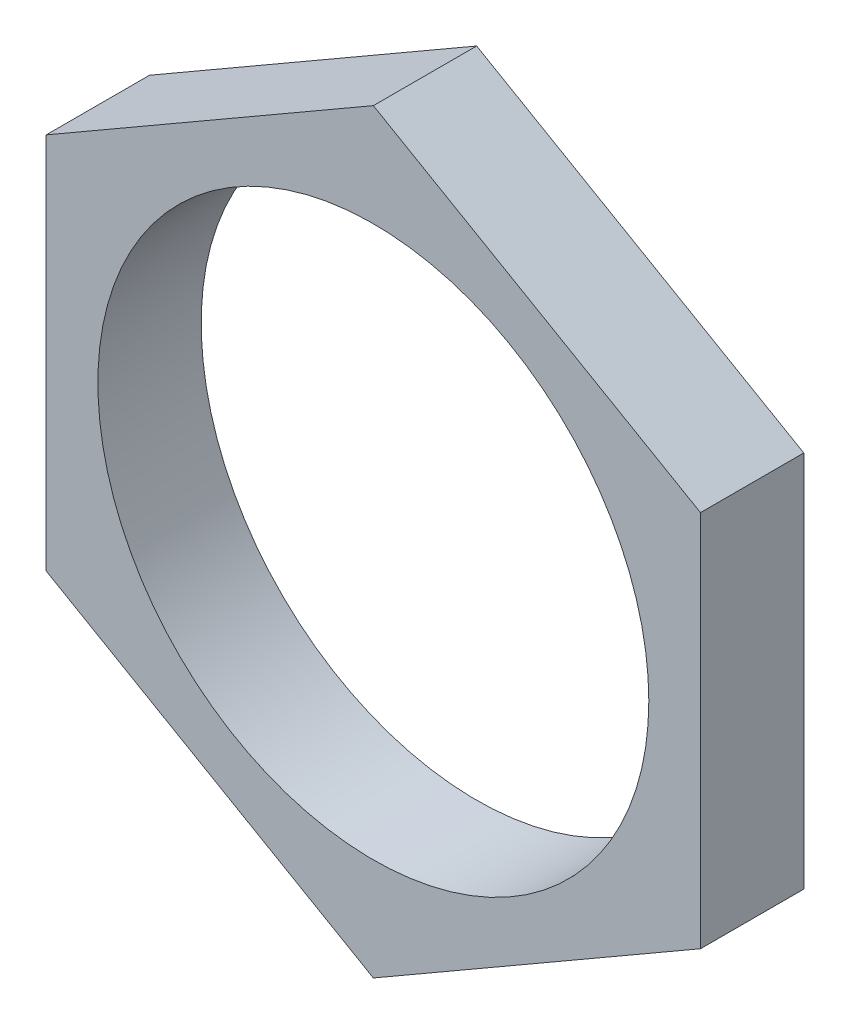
ISO-10303-21;
HEADER;
FILE_DESCRIPTION(('STEP AP214'),'2;1');
FILE_NAME('part.step','',(''),(''),'','','');
FILE_SCHEMA(('AUTOMOTIVE_DESIGN { 1 0 10303 214 1 1 1 1 }'));
ENDSEC;
DATA;
#1=APPLICATION_CONTEXT('core data for automotive mechanical design processes');
#2=APPLICATION_PROTOCOL_DEFINITION('international standard','automotive_design',2000,#1);
#3=PRODUCT_CONTEXT('',#1,'mechanical');
#4=PRODUCT('Part','Part','',(#3));
#5=PRODUCT_RELATED_PRODUCT_CATEGORY('part','',(#4));
#6=PRODUCT_DEFINITION_FORMATION('','',#4);
#7=PRODUCT_DEFINITION_CONTEXT('part definition',#1,'design');
#8=PRODUCT_DEFINITION('design','',#6,#7);
#9=PRODUCT_DEFINITION_SHAPE('','',#8);
#10=(LENGTH_UNIT() NAMED_UNIT(*) SI_UNIT(.MILLI.,.METRE.));
#11=(NAMED_UNIT(*) PLANE_ANGLE_UNIT() SI_UNIT($,.RADIAN.));
#12=(NAMED_UNIT(*) SI_UNIT($,.STERADIAN.) SOLID_ANGLE_UNIT());
#13=UNCERTAINTY_MEASURE_WITH_UNIT(LENGTH_MEASURE(1.E-05),#10,'distance_accuracy_value','');
#14=(GEOMETRIC_REPRESENTATION_CONTEXT(3) GLOBAL_UNCERTAINTY_ASSIGNED_CONTEXT((#13)) GLOBAL_UNIT_ASSIGNED_CONTEXT((#10,
#11,#12)) REPRESENTATION_CONTEXT('',''));
#15=CARTESIAN_POINT('',(0.,0.,0.));
#16=DIRECTION('',(0.,0.,1.));
#17=DIRECTION('',(1.,0.,0.));
#18=AXIS2_PLACEMENT_3D('',#15,#16,#17);
#19=CARTESIAN_POINT('',(0.,10.969655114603,3.));
#20=DIRECTION('',(0.,0.,-1.));
#21=DIRECTION('',(-1.,0.,0.));
#22=AXIS2_PLACEMENT_3D('',#19,#20,#21);
#23=PLANE('',#22);
#24=DIRECTION('',(-0.866025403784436,0.5,0.));
#25=VECTOR('',#24,1.);
#26=CARTESIAN_POINT('',(9.5,5.48482755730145,3.));
#27=LINE('',#26,#25);
#28=CARTESIAN_POINT('',(9.5,5.48482755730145,3.));
#29=VERTEX_POINT('',#28);
#30=CARTESIAN_POINT('',(0.,10.969655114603,3.));
#31=VERTEX_POINT('',#30);
#32=EDGE_CURVE('E100',#29,#31,#27,.T.);
#33=ORIENTED_EDGE('',*,*,#32,.T.);
#34=DIRECTION('',(0.866025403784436,0.5,0.));
#35=VECTOR('',#34,1.);
#36=CARTESIAN_POINT('',(-9.5,5.48482755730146,3.));
#37=LINE('',#36,#35);
#38=CARTESIAN_POINT('',(-9.5,5.48482755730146,3.));
#39=VERTEX_POINT('',#38);
#40=EDGE_CURVE('E73',#39,#31,#37,.T.);
#41=ORIENTED_EDGE('',*,*,#40,.F.);
#42=DIRECTION('',(0.,-1.,0.));
#43=VECTOR('',#42,1.);
#44=CARTESIAN_POINT('',(-9.5,5.48482755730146,3.));
#45=LINE('',#44,#43);
#46=CARTESIAN_POINT('',(-9.5,-5.48482755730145,3.));
#47=VERTEX_POINT('',#46);
#48=EDGE_CURVE('E103',#39,#47,#45,.T.);
#49=ORIENTED_EDGE('',*,*,#48,.T.);
#50=DIRECTION('',(0.866025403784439,-0.5,0.));
#51=VECTOR('',#50,1.);
#52=CARTESIAN_POINT('',(-9.5,-5.48482755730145,3.));
#53=LINE('',#52,#51);
#54=CARTESIAN_POINT('',(0.,-10.9696551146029,3.));
#55=VERTEX_POINT('',#54);
#56=EDGE_CURVE('E106',#47,#55,#53,.T.);
#57=ORIENTED_EDGE('',*,*,#56,.T.);
#58=DIRECTION('',(-0.86602540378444,-0.5,0.));
#59=VECTOR('',#58,1.);
#60=CARTESIAN_POINT('',(9.5,-5.48482755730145,3.));
#61=LINE('',#60,#59);
#62=CARTESIAN_POINT('',(9.5,-5.48482755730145,3.));
#63=VERTEX_POINT('',#62);
#64=EDGE_CURVE('E109',#63,#55,#61,.T.);
#65=ORIENTED_EDGE('',*,*,#64,.F.);
#66=DIRECTION('',(0.,-1.,0.));
#67=VECTOR('',#66,1.);
#68=CARTESIAN_POINT('',(9.5,5.48482755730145,3.));
#69=LINE('',#68,#67);
#70=EDGE_CURVE('E111',#29,#63,#69,.T.);
#71=ORIENTED_EDGE('',*,*,#70,.F.);
#72=EDGE_LOOP('',(#33,#41,#49,#57,#65,#71));
#73=FACE_BOUND('',#72,.T.);
#74=CARTESIAN_POINT('',(0.,0.,3.));
#75=DIRECTION('',(0.,0.,1.));
#76=DIRECTION('',(1.,0.,0.));
#77=AXIS2_PLACEMENT_3D('',#74,#75,#76);
#78=CIRCLE('',#77,8.);
#79=CARTESIAN_POINT('',(8.,0.,3.));
#80=VERTEX_POINT('',#79);
#81=EDGE_CURVE('E81',#80,#80,#78,.T.);
#82=ORIENTED_EDGE('',*,*,#81,.F.);
#83=EDGE_LOOP('',(#82));
#84=FACE_BOUND('',#83,.T.);
#85=ADVANCED_FACE('F14',(#73,#84),#23,.F.);
#86=CARTESIAN_POINT('',(0.,10.969655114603,0.));
#87=DIRECTION('',(0.,0.,-1.));
#88=DIRECTION('',(-1.,0.,0.));
#89=AXIS2_PLACEMENT_3D('',#86,#87,#88);
#90=PLANE('',#89);
#91=DIRECTION('',(-0.866025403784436,0.5,0.));
#92=VECTOR('',#91,1.);
#93=CARTESIAN_POINT('',(9.5,5.48482755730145,0.));
#94=LINE('',#93,#92);
#95=CARTESIAN_POINT('',(9.5,5.48482755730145,0.));
#96=VERTEX_POINT('',#95);
#97=CARTESIAN_POINT('',(0.,10.969655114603,0.));
#98=VERTEX_POINT('',#97);
#99=EDGE_CURVE('E77',#96,#98,#94,.T.);
#100=ORIENTED_EDGE('',*,*,#99,.F.);
#101=DIRECTION('',(0.,-1.,0.));
#102=VECTOR('',#101,1.);
#103=CARTESIAN_POINT('',(9.5,5.48482755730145,0.));
#104=LINE('',#103,#102);
#105=CARTESIAN_POINT('',(9.5,-5.48482755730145,0.));
#106=VERTEX_POINT('',#105);
#107=EDGE_CURVE('E98',#96,#106,#104,.T.);
#108=ORIENTED_EDGE('',*,*,#107,.T.);
#109=DIRECTION('',(-0.86602540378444,-0.5,0.));
#110=VECTOR('',#109,1.);
#111=CARTESIAN_POINT('',(9.5,-5.48482755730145,0.));
#112=LINE('',#111,#110);
#113=CARTESIAN_POINT('',(0.,-10.9696551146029,0.));
#114=VERTEX_POINT('',#113);
#115=EDGE_CURVE('E95',#106,#114,#112,.T.);
#116=ORIENTED_EDGE('',*,*,#115,.T.);
#117=DIRECTION('',(0.866025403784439,-0.5,0.));
#118=VECTOR('',#117,1.);
#119=CARTESIAN_POINT('',(-9.5,-5.48482755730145,0.));
#120=LINE('',#119,#118);
#121=CARTESIAN_POINT('',(-9.5,-5.48482755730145,0.));
#122=VERTEX_POINT('',#121);
#123=EDGE_CURVE('E89',#122,#114,#120,.T.);
#124=ORIENTED_EDGE('',*,*,#123,.F.);
#125=DIRECTION('',(0.,-1.,0.));
#126=VECTOR('',#125,1.);
#127=CARTESIAN_POINT('',(-9.5,5.48482755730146,0.));
#128=LINE('',#127,#126);
#129=CARTESIAN_POINT('',(-9.5,5.48482755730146,0.));
#130=VERTEX_POINT('',#129);
#131=EDGE_CURVE('E87',#130,#122,#128,.T.);
#132=ORIENTED_EDGE('',*,*,#131,.F.);
#133=DIRECTION('',(0.866025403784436,0.5,0.));
#134=VECTOR('',#133,1.);
#135=CARTESIAN_POINT('',(-9.5,5.48482755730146,0.));
#136=LINE('',#135,#134);
#137=EDGE_CURVE('E70',#130,#98,#136,.T.);
#138=ORIENTED_EDGE('',*,*,#137,.T.);
#139=EDGE_LOOP('',(#100,#108,#116,#124,#132,#138));
#140=FACE_BOUND('',#139,.T.);
#141=CARTESIAN_POINT('',(0.,0.,0.));
#142=DIRECTION('',(0.,0.,1.));
#143=DIRECTION('',(1.,0.,0.));
#144=AXIS2_PLACEMENT_3D('',#141,#142,#143);
#145=CIRCLE('',#144,8.);
#146=CARTESIAN_POINT('',(8.,0.,0.));
#147=VERTEX_POINT('',#146);
#148=EDGE_CURVE('E164',#147,#147,#145,.T.);
#149=ORIENTED_EDGE('',*,*,#148,.T.);
#150=EDGE_LOOP('',(#149));
#151=FACE_BOUND('',#150,.T.);
#152=ADVANCED_FACE('F83',(#140,#151),#90,.T.);
#153=CARTESIAN_POINT('',(9.5,5.48482755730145,3.));
#154=DIRECTION('',(-0.5,-0.866025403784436,0.));
#155=DIRECTION('',(0.866025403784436,-0.5,0.));
#156=AXIS2_PLACEMENT_3D('',#153,#154,#155);
#157=PLANE('',#156);
#158=DIRECTION('',(0.,0.,-1.));
#159=VECTOR('',#158,1.);
#160=CARTESIAN_POINT('',(0.,10.969655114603,3.));
#161=LINE('',#160,#159);
#162=EDGE_CURVE('E9',#31,#98,#161,.T.);
#163=ORIENTED_EDGE('',*,*,#162,.F.);
#164=ORIENTED_EDGE('',*,*,#32,.F.);
#165=DIRECTION('',(0.,0.,-1.));
#166=VECTOR('',#165,1.);
#167=CARTESIAN_POINT('',(9.5,5.48482755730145,3.));
#168=LINE('',#167,#166);
#169=EDGE_CURVE('E29',#29,#96,#168,.T.);
#170=ORIENTED_EDGE('',*,*,#169,.T.);
#171=ORIENTED_EDGE('',*,*,#99,.T.);
#172=EDGE_LOOP('',(#163,#164,#170,#171));
#173=FACE_BOUND('',#172,.T.);
#174=ADVANCED_FACE('F78',(#173),#157,.F.);
#175=CARTESIAN_POINT('',(-9.5,5.48482755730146,3.));
#176=DIRECTION('',(-0.5,0.866025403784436,0.));
#177=DIRECTION('',(-0.866025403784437,-0.5,0.));
#178=AXIS2_PLACEMENT_3D('',#175,#176,#177);
#179=PLANE('',#178);
#180=DIRECTION('',(0.,0.,-1.));
#181=VECTOR('',#180,1.);
#182=CARTESIAN_POINT('',(-9.5,5.48482755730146,3.));
#183=LINE('',#182,#181);
#184=EDGE_CURVE('E22',#39,#130,#183,.T.);
#185=ORIENTED_EDGE('',*,*,#184,.F.);
#186=ORIENTED_EDGE('',*,*,#40,.T.);
#187=ORIENTED_EDGE('',*,*,#162,.T.);
#188=ORIENTED_EDGE('',*,*,#137,.F.);
#189=EDGE_LOOP('',(#185,#186,#187,#188));
#190=FACE_BOUND('',#189,.T.);
#191=ADVANCED_FACE('F16',(#190),#179,.T.);
#192=CARTESIAN_POINT('',(-9.5,5.48482755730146,3.));
#193=DIRECTION('',(1.,0.,0.));
#194=DIRECTION('',(0.,1.,0.));
#195=AXIS2_PLACEMENT_3D('',#192,#193,#194);
#196=PLANE('',#195);
#197=DIRECTION('',(0.,0.,-1.));
#198=VECTOR('',#197,1.);
#199=CARTESIAN_POINT('',(-9.5,-5.48482755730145,3.));
#200=LINE('',#199,#198);
#201=EDGE_CURVE('E117',#47,#122,#200,.T.);
#202=ORIENTED_EDGE('',*,*,#201,.F.);
#203=ORIENTED_EDGE('',*,*,#48,.F.);
#204=ORIENTED_EDGE('',*,*,#184,.T.);
#205=ORIENTED_EDGE('',*,*,#131,.T.);
#206=EDGE_LOOP('',(#202,#203,#204,#205));
#207=FACE_BOUND('',#206,.T.);
#208=ADVANCED_FACE('F120',(#207),#196,.F.);
#209=CARTESIAN_POINT('',(-9.5,-5.48482755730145,3.));
#210=DIRECTION('',(0.5,0.866025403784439,0.));
#211=DIRECTION('',(-0.86602540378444,0.5,0.));
#212=AXIS2_PLACEMENT_3D('',#209,#210,#211);
#213=PLANE('',#212);
#214=DIRECTION('',(0.,0.,-1.));
#215=VECTOR('',#214,1.);
#216=CARTESIAN_POINT('',(0.,-10.9696551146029,3.));
#217=LINE('',#216,#215);
#218=EDGE_CURVE('E115',#55,#114,#217,.T.);
#219=ORIENTED_EDGE('',*,*,#218,.F.);
#220=ORIENTED_EDGE('',*,*,#56,.F.);
#221=ORIENTED_EDGE('',*,*,#201,.T.);
#222=ORIENTED_EDGE('',*,*,#123,.T.);
#223=EDGE_LOOP('',(#219,#220,#221,#222));
#224=FACE_BOUND('',#223,.T.);
#225=ADVANCED_FACE('F128',(#224),#213,.F.);
#226=CARTESIAN_POINT('',(9.5,-5.48482755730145,3.));
#227=DIRECTION('',(0.5,-0.86602540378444,0.));
#228=DIRECTION('',(0.86602540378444,0.5,0.));
#229=AXIS2_PLACEMENT_3D('',#226,#227,#228);
#230=PLANE('',#229);
#231=DIRECTION('',(0.,0.,-1.));
#232=VECTOR('',#231,1.);
#233=CARTESIAN_POINT('',(9.5,-5.48482755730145,3.));
#234=LINE('',#233,#232);
#235=EDGE_CURVE('E37',#63,#106,#234,.T.);
#236=ORIENTED_EDGE('',*,*,#235,.F.);
#237=ORIENTED_EDGE('',*,*,#64,.T.);
#238=ORIENTED_EDGE('',*,*,#218,.T.);
#239=ORIENTED_EDGE('',*,*,#115,.F.);
#240=EDGE_LOOP('',(#236,#237,#238,#239));
#241=FACE_BOUND('',#240,.T.);
#242=ADVANCED_FACE('F126',(#241),#230,.T.);
#243=CARTESIAN_POINT('',(9.5,5.48482755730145,3.));
#244=DIRECTION('',(1.,0.,0.));
#245=DIRECTION('',(0.,1.,0.));
#246=AXIS2_PLACEMENT_3D('',#243,#244,#245);
#247=PLANE('',#246);
#248=ORIENTED_EDGE('',*,*,#70,.T.);
#249=ORIENTED_EDGE('',*,*,#235,.T.);
#250=ORIENTED_EDGE('',*,*,#107,.F.);
#251=ORIENTED_EDGE('',*,*,#169,.F.);
#252=EDGE_LOOP('',(#248,#249,#250,#251));
#253=FACE_BOUND('',#252,.T.);
#254=ADVANCED_FACE('F125',(#253),#247,.T.);
#255=CARTESIAN_POINT('',(0.,0.,3.));
#256=DIRECTION('',(0.,0.,-1.));
#257=DIRECTION('',(-1.,0.,0.));
#258=AXIS2_PLACEMENT_3D('',#255,#256,#257);
#259=CYLINDRICAL_SURFACE('',#258,8.);
#260=ORIENTED_EDGE('',*,*,#81,.T.);
#261=EDGE_LOOP('',(#260));
#262=FACE_BOUND('',#261,.T.);
#263=ORIENTED_EDGE('',*,*,#148,.F.);
#264=EDGE_LOOP('',(#263));
#265=FACE_BOUND('',#264,.T.);
#266=ADVANCED_FACE('F150',(#262,#265),#259,.F.);
#267=CLOSED_SHELL('',(#85,#152,#174,#191,#208,#225,#242,#254,#266));
#268=MANIFOLD_SOLID_BREP('B1',#267);
#269=ADVANCED_BREP_SHAPE_REPRESENTATION('',(#18,#268),#14);
#270=SHAPE_DEFINITION_REPRESENTATION(#9,#269);
ENDSEC;
END-ISO-10303-21;
